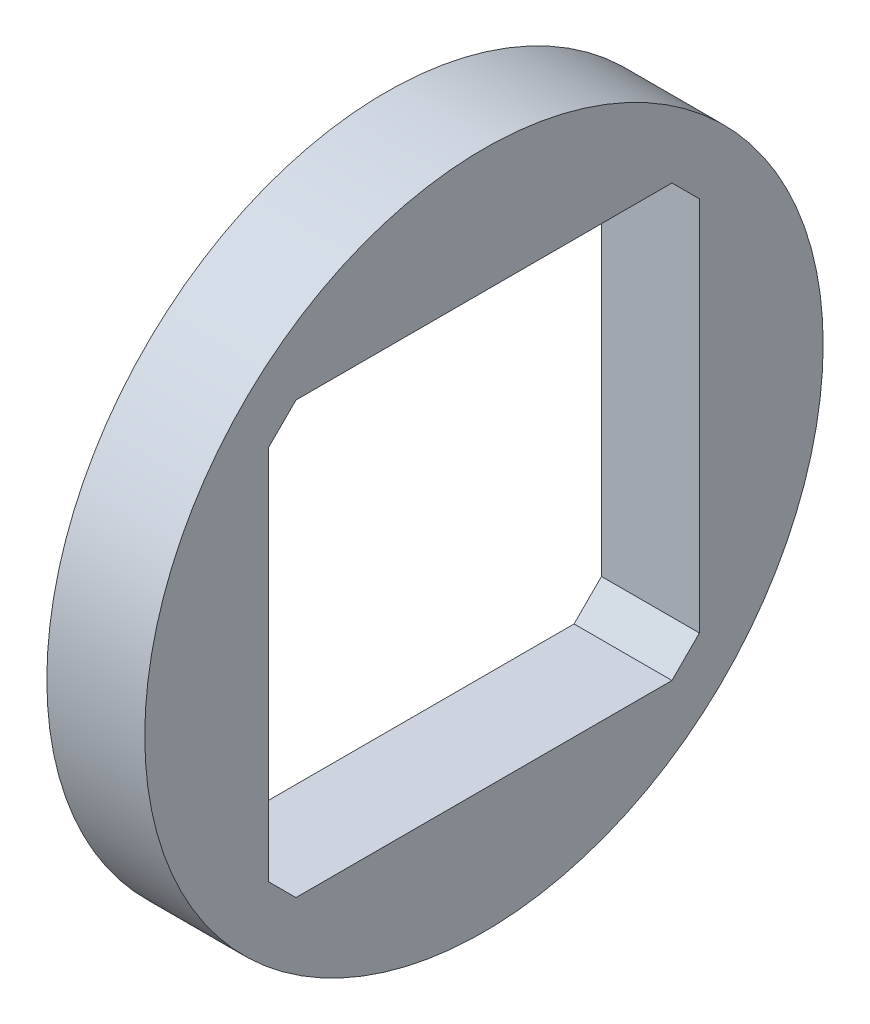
from build123d import *

# Parameters (mm, degrees)
SKETCH1_R           = 21.997045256
BOSS_EXTRUDE1_DEPTH = 6.35
CUT_EXTRUDE1_DEPTH  = 6.35


with BuildPart() as part:
    # Sketch1 → Boss-Extrude1 (new body)
    with BuildSketch(Plane(origin=(0, 0, 0), x_dir=(0, 0, -1), z_dir=(1, 0, 0))):
        Circle(SKETCH1_R)
    extrude(amount=BOSS_EXTRUDE1_DEPTH)

    # Sketch3 → Cut-Extrude1 (cut)
    with BuildSketch(Plane.ZY):
        Polygon((-12.192, 13.97), (-13.97, 12.192), (-13.97, -12.192), (-12.192, -13.97), (12.192, -13.97), (13.97, -12.192), (13.97, 12.192), (12.192, 13.97), align=None)
    extrude(amount=-CUT_EXTRUDE1_DEPTH, mode=Mode.SUBTRACT)


solid = part.part
